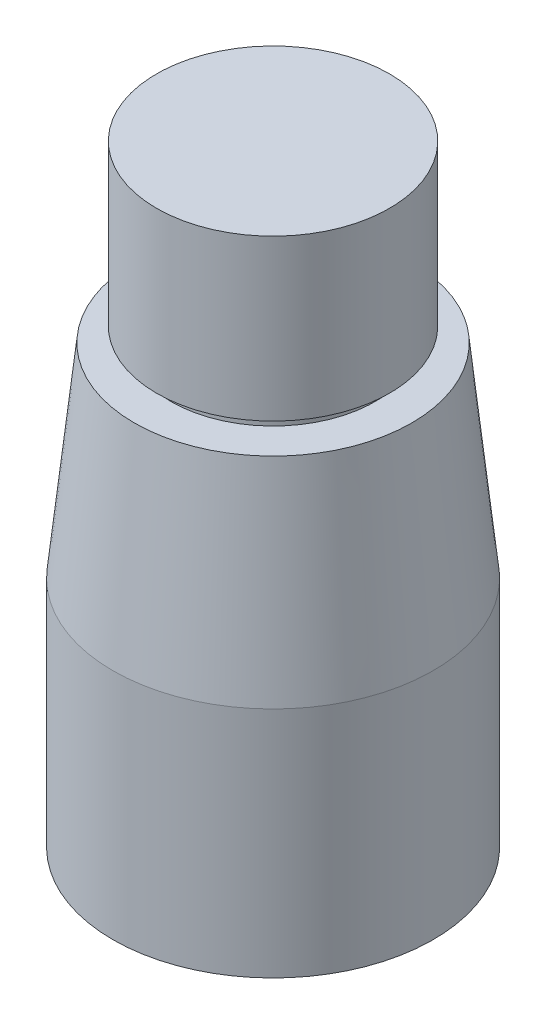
from build123d import *


with BuildPart() as part:
    # Sketch1 → Revolve1 (revolve)
    with BuildSketch(Plane.XY, mode=Mode.PRIVATE) as revolve1_sk:
        Polygon((0, 0), (-11, 0), (-11, 16), (-9.528540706, 30), (-7, 30), (-7, 31), (-8, 31), (-8, 42), (0, 42), align=None)
    revolve(revolve1_sk.sketch.rotate(Axis((0, 85.10264496, 0), (0, -1, 0)), 270), axis=Axis((0, 85.10264496, 0), (0, -1, 0)))


solid = part.part
